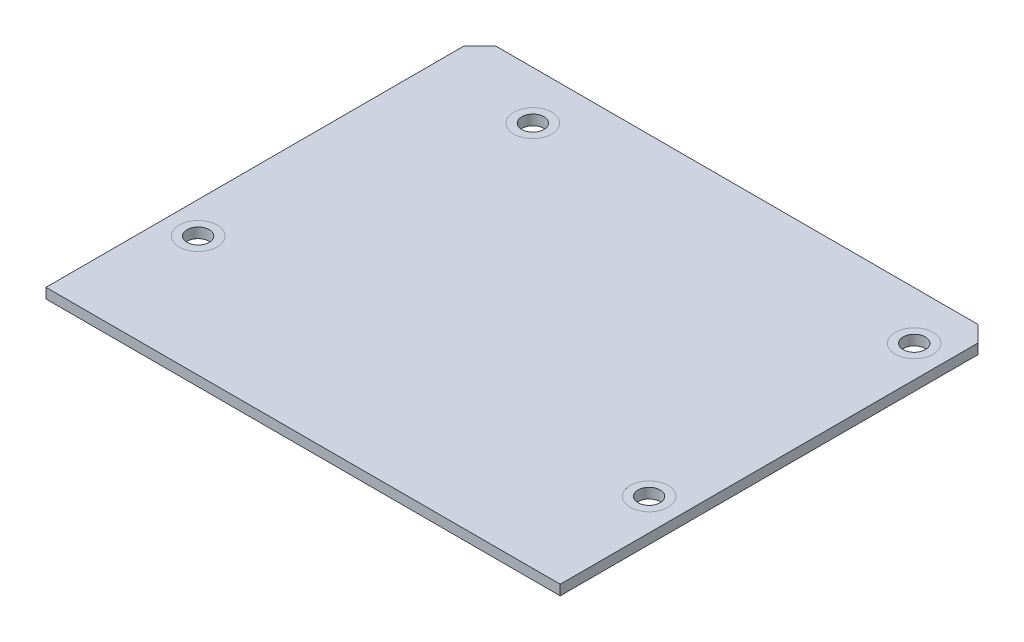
from build123d import *

# Parameters (mm, degrees)
SKETCH1_W           = 81.28
SKETCH1_H           = 68.58
BOSS_EXTRUDE1_DEPTH = 1.6
CHAMFER1_SIZE       = 2.54
CUT_EXTRUDE1_REACH  = 55.197
SKETCH2_R           = 1.75
SKETCH3_R           = 3
CUT_EXTRUDE2_DEPTH  = 0.0001


with BuildPart() as part:
    # Sketch1 → Boss-Extrude1 (new body)
    with BuildSketch(Plane(origin=(0, 0, 0), x_dir=(1, 0, 0), z_dir=(0, 1, 0))):
        Rectangle(SKETCH1_W, SKETCH1_H)
    extrude(amount=BOSS_EXTRUDE1_DEPTH)

    # Chamfer1
    chamfer1_edges = [part.edges().sort_by_distance(p)[0] for p in [
        (-40.64, 0.8, -34.29),
        (40.64, 0.8, -34.29),
    ]]
    chamfer(chamfer1_edges, length=CHAMFER1_SIZE)

    # Sketch2 → Cut-Extrude1 (cut, up to next)
    with BuildSketch(Plane(origin=(0, 1.6, 0), x_dir=(1, 0, 0), z_dir=(0, 1, 0)), mode=Mode.PRIVATE) as cut_extrude1_sk1:
        with Locations(Location((-24.64, 26.67, 0), (0, 0, 270))):
            Circle(SKETCH2_R)
    cut_extrude1_tool1 = extrude(cut_extrude1_sk1.sketch, amount=-CUT_EXTRUDE1_REACH, mode=Mode.PRIVATE) & part.part
    # Sketch2 → Cut-Extrude1 (cut, up to next)
    with BuildSketch(Plane(origin=(0, 1.6, 0), x_dir=(1, 0, 0), z_dir=(0, 1, 0)), mode=Mode.PRIVATE) as cut_extrude1_sk2:
        with Locations(Location((35.64, 26.67, 0), (0, 0, 270))):
            Circle(SKETCH2_R)
    cut_extrude1_tool2 = extrude(cut_extrude1_sk2.sketch, amount=-CUT_EXTRUDE1_REACH, mode=Mode.PRIVATE) & part.part
    # Sketch2 → Cut-Extrude1 (cut, up to next)
    with BuildSketch(Plane(origin=(0, 1.6, 0), x_dir=(1, 0, 0), z_dir=(0, 1, 0)), mode=Mode.PRIVATE) as cut_extrude1_sk3:
        with Locations(Location((35.64, -15.24, 0), (0, 0, 270))):
            Circle(SKETCH2_R)
    cut_extrude1_tool3 = extrude(cut_extrude1_sk3.sketch, amount=-CUT_EXTRUDE1_REACH, mode=Mode.PRIVATE) & part.part
    # Sketch2 → Cut-Extrude1 (cut, up to next)
    with BuildSketch(Plane(origin=(0, 1.6, 0), x_dir=(1, 0, 0), z_dir=(0, 1, 0)), mode=Mode.PRIVATE) as cut_extrude1_sk4:
        with Locations(Location((-35.64, -15.24, 0), (0, 0, 270))):
            Circle(SKETCH2_R)
    cut_extrude1_tool4 = extrude(cut_extrude1_sk4.sketch, amount=-CUT_EXTRUDE1_REACH, mode=Mode.PRIVATE) & part.part
    add(cut_extrude1_tool1.solids().sort_by_distance((-24.64, 1.6, -26.67))[0], mode=Mode.SUBTRACT)
    add(cut_extrude1_tool2.solids().sort_by_distance((35.64, 1.6, -26.67))[0], mode=Mode.SUBTRACT)
    add(cut_extrude1_tool3.solids().sort_by_distance((35.64, 1.6, 15.24))[0], mode=Mode.SUBTRACT)
    add(cut_extrude1_tool4.solids().sort_by_distance((-35.64, 1.6, 15.24))[0], mode=Mode.SUBTRACT)

    # Sketch3 → Cut-Extrude2 (cut)
    with BuildSketch(Plane(origin=(0, 1.6, 0), x_dir=(1, 0, 0), z_dir=(0, 1, 0))):
        with Locations(Location((-24.64, 26.67, 0), (0, 0, 270))):
            Circle(SKETCH3_R)
        with Locations(Location((35.64, 26.67, 0), (0, 0, 270))):
            Circle(SKETCH3_R)
        with Locations(Location((-35.64, -15.24, 0), (0, 0, 270))):
            Circle(SKETCH3_R)
        with Locations(Location((35.64, -15.24, 0), (0, 0, 270))):
            Circle(SKETCH3_R)
    extrude(amount=-CUT_EXTRUDE2_DEPTH, mode=Mode.SUBTRACT)


solid = part.part
